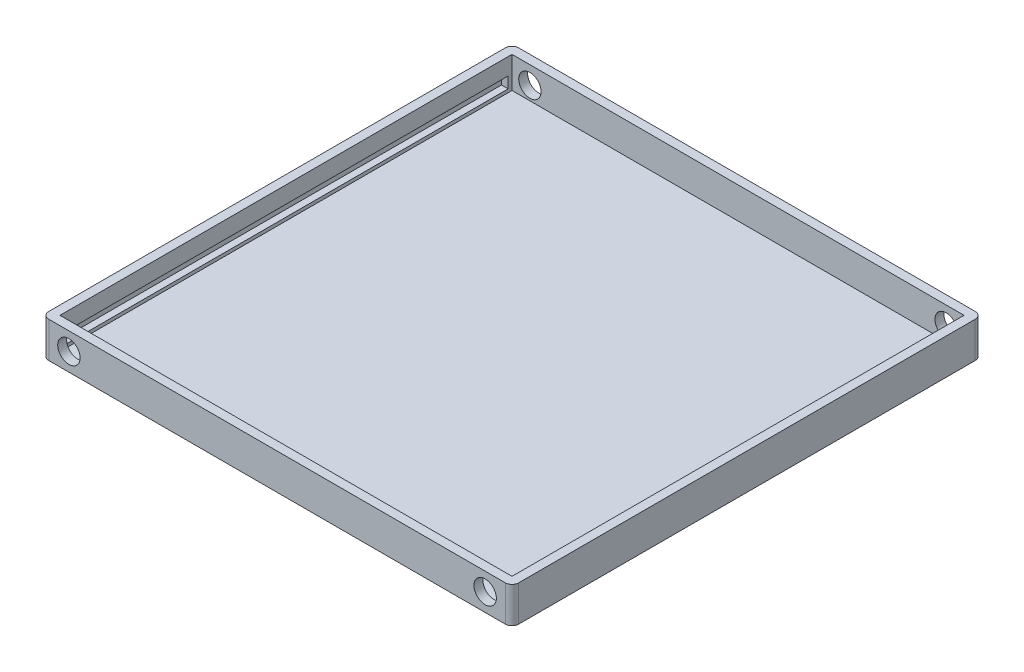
from build123d import *

# Parameters (mm, degrees)
SKETCH2_W           = 105
SKETCH2_H           = 105
BOSS_EXTRUDE1_DEPTH = 8
SKETCH3_W           = 101
SKETCH3_H           = 101
CUT_EXTRUDE1_DEPTH  = 7
SKETCH7_W           = 101
SKETCH7_H           = 2.5
CUT_EXTRUDE4_DEPTH  = 1.5
FILLET2_R           = 1.5
SKETCH8_R           = 2.5
CUT_EXTRUDE6_DEPTH  = 10


with BuildPart() as part:
    # Sketch2 → Boss-Extrude1 (new body)
    with BuildSketch(Plane(origin=(0, 0, 0), x_dir=(1, 0, 0), z_dir=(0, 1, 0))):
        Rectangle(SKETCH2_W, SKETCH2_H)
    extrude(amount=BOSS_EXTRUDE1_DEPTH)

    # Sketch3 → Cut-Extrude1 (cut)
    with BuildSketch(Plane(origin=(0, 8, 0), x_dir=(1, 0, 0), z_dir=(0, 1, 0))):
        Rectangle(SKETCH3_W, SKETCH3_H)
    extrude(amount=-CUT_EXTRUDE1_DEPTH, mode=Mode.SUBTRACT)

    # Sketch7 → Cut-Extrude4 (cut)
    with BuildSketch(Plane(origin=(-50.5, 0, 0), x_dir=(0, 0, -1), z_dir=(1, 0, 0))):
        with Locations((-0.84816069, 2.999324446)):
            Rectangle(SKETCH7_W, SKETCH7_H)
    cut_extrude4 = extrude(amount=-CUT_EXTRUDE4_DEPTH, mode=Mode.SUBTRACT)

    # Fillet2
    fillet2_edges = [part.edges().sort_by_distance(p)[0] for p in [
        (-52.5, 4, -52.5),
        (52.5, 4, -52.5),
        (52.5, 4, 52.5),
        (-52.5, 4, 52.5),
    ]]
    fillet(fillet2_edges, radius=FILLET2_R)

    # Mirror2: Cut-Extrude4 across plane
    add(cut_extrude4.mirror(Plane(origin=(0, 0, 0), x_dir=(0, 0, 1), z_dir=(1, 0, 0))), mode=Mode.SUBTRACT)

    # Sketch8 → Cut-Extrude6 (cut)
    with BuildSketch(Plane.XY.offset(52.5)):
        with Locations((-46.5, 4)):
            Circle(SKETCH8_R)
        with Locations((46.5, 4)):
            Circle(SKETCH8_R)
    cut_extrude6 = extrude(amount=-CUT_EXTRUDE6_DEPTH, mode=Mode.SUBTRACT)

    # Mirror3: Cut-Extrude6 across plane
    add(cut_extrude6.mirror(Plane.XY), mode=Mode.SUBTRACT)


solid = part.part
